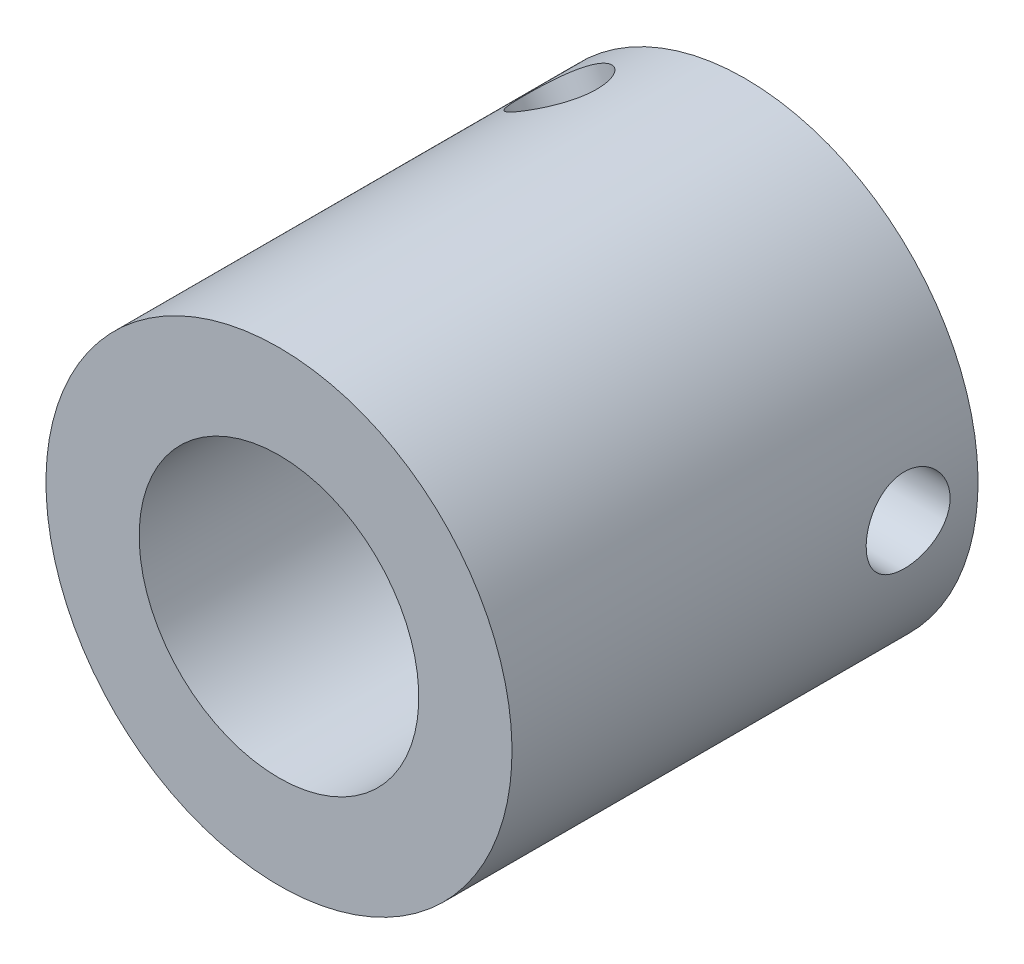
ISO-10303-21;
HEADER;
FILE_DESCRIPTION(('STEP AP214'),'2;1');
FILE_NAME('part.step','',(''),(''),'','','');
FILE_SCHEMA(('AUTOMOTIVE_DESIGN { 1 0 10303 214 1 1 1 1 }'));
ENDSEC;
DATA;
#1=APPLICATION_CONTEXT('core data for automotive mechanical design processes');
#2=APPLICATION_PROTOCOL_DEFINITION('international standard','automotive_design',2000,#1);
#3=PRODUCT_CONTEXT('',#1,'mechanical');
#4=PRODUCT('Part','Part','',(#3));
#5=PRODUCT_RELATED_PRODUCT_CATEGORY('part','',(#4));
#6=PRODUCT_DEFINITION_FORMATION('','',#4);
#7=PRODUCT_DEFINITION_CONTEXT('part definition',#1,'design');
#8=PRODUCT_DEFINITION('design','',#6,#7);
#9=PRODUCT_DEFINITION_SHAPE('','',#8);
#10=(LENGTH_UNIT() NAMED_UNIT(*) SI_UNIT(.MILLI.,.METRE.));
#11=(NAMED_UNIT(*) PLANE_ANGLE_UNIT() SI_UNIT($,.RADIAN.));
#12=(NAMED_UNIT(*) SI_UNIT($,.STERADIAN.) SOLID_ANGLE_UNIT());
#13=UNCERTAINTY_MEASURE_WITH_UNIT(LENGTH_MEASURE(1.E-05),#10,'distance_accuracy_value','');
#14=(GEOMETRIC_REPRESENTATION_CONTEXT(3) GLOBAL_UNCERTAINTY_ASSIGNED_CONTEXT((#13)) GLOBAL_UNIT_ASSIGNED_CONTEXT((#10,
#11,#12)) REPRESENTATION_CONTEXT('',''));
#15=CARTESIAN_POINT('',(0.,0.,0.));
#16=DIRECTION('',(0.,0.,1.));
#17=DIRECTION('',(1.,0.,0.));
#18=AXIS2_PLACEMENT_3D('',#15,#16,#17);
#19=CARTESIAN_POINT('',(10.,0.,3.));
#20=DIRECTION('',(1.,0.,0.));
#21=DIRECTION('',(0.,0.,1.));
#22=AXIS2_PLACEMENT_3D('',#19,#20,#21);
#23=CYLINDRICAL_SURFACE('',#22,1.8);
#24=CARTESIAN_POINT('',(6.,0.,1.2));
#25=CARTESIAN_POINT('',(5.99999644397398,-0.0986185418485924,1.20000535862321));
#26=CARTESIAN_POINT('',(5.9975419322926,-0.197344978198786,1.20814170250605));
#27=CARTESIAN_POINT('',(5.98797637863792,-0.392019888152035,1.240429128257));
#28=CARTESIAN_POINT('',(5.98085713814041,-0.487963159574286,1.26460840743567));
#29=CARTESIAN_POINT('',(5.96274502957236,-0.67408989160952,1.32810047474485));
#30=CARTESIAN_POINT('',(5.95176011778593,-0.764284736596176,1.36738219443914));
#31=CARTESIAN_POINT('',(5.92706108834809,-0.936775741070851,1.4598598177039));
#32=CARTESIAN_POINT('',(5.91334745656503,-1.01907330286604,1.51305324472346));
#33=CARTESIAN_POINT('',(5.88420923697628,-1.17584367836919,1.63346715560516));
#34=CARTESIAN_POINT('',(5.86874944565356,-1.25005754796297,1.7010162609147));
#35=CARTESIAN_POINT('',(5.83807084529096,-1.38629574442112,1.84752676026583));
#36=CARTESIAN_POINT('',(5.82285209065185,-1.44831735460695,1.92649069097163));
#37=CARTESIAN_POINT('',(5.79400932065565,-1.55976060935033,2.09576517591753));
#38=CARTESIAN_POINT('',(5.78042879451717,-1.60886801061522,2.18629072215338));
#39=CARTESIAN_POINT('',(5.75692338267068,-1.69105695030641,2.37478771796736));
#40=CARTESIAN_POINT('',(5.74699759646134,-1.72414243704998,2.47275732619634));
#41=CARTESIAN_POINT('',(5.73229045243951,-1.77241959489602,2.67046828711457));
#42=CARTESIAN_POINT('',(5.72737283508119,-1.78808634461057,2.77008322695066));
#43=CARTESIAN_POINT('',(5.72283347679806,-1.80256476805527,2.97063972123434));
#44=CARTESIAN_POINT('',(5.72321045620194,-1.80138051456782,3.071580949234));
#45=CARTESIAN_POINT('',(5.72909692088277,-1.7825637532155,3.26806042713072));
#46=CARTESIAN_POINT('',(5.734420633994,-1.76552656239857,3.36366217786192));
#47=CARTESIAN_POINT('',(5.7493002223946,-1.71644921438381,3.55058324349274));
#48=CARTESIAN_POINT('',(5.7588565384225,-1.68440749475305,3.6419021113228));
#49=CARTESIAN_POINT('',(5.78127313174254,-1.60579117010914,3.81912306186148));
#50=CARTESIAN_POINT('',(5.79417696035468,-1.55902311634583,3.90493358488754));
#51=CARTESIAN_POINT('',(5.82181271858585,-1.4524190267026,4.06768300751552));
#52=CARTESIAN_POINT('',(5.83654498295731,-1.39258059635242,4.14462027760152));
#53=CARTESIAN_POINT('',(5.86692929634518,-1.25858836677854,4.29080973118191));
#54=CARTESIAN_POINT('',(5.88259411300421,-1.18394259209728,4.35960905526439));
#55=CARTESIAN_POINT('',(5.91254166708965,-1.0239459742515,4.48384449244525));
#56=CARTESIAN_POINT('',(5.92682380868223,-0.93859055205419,4.5392748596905));
#57=CARTESIAN_POINT('',(5.95252954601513,-0.758749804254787,4.63547494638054));
#58=CARTESIAN_POINT('',(5.96393115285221,-0.664201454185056,4.67613287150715));
#59=CARTESIAN_POINT('',(5.98241497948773,-0.469295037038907,4.74076423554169));
#60=CARTESIAN_POINT('',(5.98950610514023,-0.368949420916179,4.76477208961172));
#61=CARTESIAN_POINT('',(5.99601591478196,-0.223094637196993,4.78668306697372));
#62=CARTESIAN_POINT('',(5.99750582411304,-0.178642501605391,4.79167133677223));
#63=CARTESIAN_POINT('',(5.99949867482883,-0.089467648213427,4.79833102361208));
#64=CARTESIAN_POINT('',(6.00000161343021,-0.044744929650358,4.80000243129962));
#65=CARTESIAN_POINT('',(5.99999644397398,0.0986185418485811,4.79999464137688));
#66=CARTESIAN_POINT('',(5.9975419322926,0.197344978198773,4.79185829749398));
#67=CARTESIAN_POINT('',(5.98797637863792,0.392019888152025,4.75957087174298));
#68=CARTESIAN_POINT('',(5.98085713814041,0.487963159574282,4.73539159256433));
#69=CARTESIAN_POINT('',(5.96274502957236,0.674089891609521,4.67189952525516));
#70=CARTESIAN_POINT('',(5.95176011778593,0.764284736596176,4.63261780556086));
#71=CARTESIAN_POINT('',(5.92706108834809,0.936775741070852,4.5401401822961));
#72=CARTESIAN_POINT('',(5.91334745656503,1.01907330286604,4.48694675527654));
#73=CARTESIAN_POINT('',(5.88420923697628,1.17584367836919,4.36653284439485));
#74=CARTESIAN_POINT('',(5.86874944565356,1.25005754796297,4.2989837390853));
#75=CARTESIAN_POINT('',(5.83807084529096,1.38629574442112,4.15247323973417));
#76=CARTESIAN_POINT('',(5.82285209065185,1.44831735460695,4.07350930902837));
#77=CARTESIAN_POINT('',(5.79400932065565,1.55976060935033,3.90423482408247));
#78=CARTESIAN_POINT('',(5.78042879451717,1.60886801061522,3.81370927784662));
#79=CARTESIAN_POINT('',(5.75692338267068,1.69105695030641,3.62521228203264));
#80=CARTESIAN_POINT('',(5.74699759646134,1.72414243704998,3.52724267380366));
#81=CARTESIAN_POINT('',(5.73229045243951,1.77241959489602,3.32953171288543));
#82=CARTESIAN_POINT('',(5.72737283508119,1.78808634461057,3.22991677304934));
#83=CARTESIAN_POINT('',(5.72283347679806,1.80256476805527,3.02936027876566));
#84=CARTESIAN_POINT('',(5.72321045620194,1.80138051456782,2.92841905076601));
#85=CARTESIAN_POINT('',(5.72909692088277,1.7825637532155,2.73193957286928));
#86=CARTESIAN_POINT('',(5.734420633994,1.76552656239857,2.63633782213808));
#87=CARTESIAN_POINT('',(5.7493002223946,1.71644921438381,2.44941675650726));
#88=CARTESIAN_POINT('',(5.7588565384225,1.68440749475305,2.3580978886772));
#89=CARTESIAN_POINT('',(5.78127313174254,1.60579117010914,2.18087693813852));
#90=CARTESIAN_POINT('',(5.79417696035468,1.55902311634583,2.09506641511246));
#91=CARTESIAN_POINT('',(5.82181271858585,1.4524190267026,1.93231699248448));
#92=CARTESIAN_POINT('',(5.83654498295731,1.39258059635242,1.85537972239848));
#93=CARTESIAN_POINT('',(5.86692929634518,1.25858836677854,1.70919026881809));
#94=CARTESIAN_POINT('',(5.88259411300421,1.18394259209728,1.64039094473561));
#95=CARTESIAN_POINT('',(5.91254166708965,1.0239459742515,1.51615550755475));
#96=CARTESIAN_POINT('',(5.92682380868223,0.93859055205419,1.4607251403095));
#97=CARTESIAN_POINT('',(5.95252954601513,0.758749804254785,1.36452505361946));
#98=CARTESIAN_POINT('',(5.96393115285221,0.664201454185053,1.32386712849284));
#99=CARTESIAN_POINT('',(5.98241497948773,0.469295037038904,1.25923576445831));
#100=CARTESIAN_POINT('',(5.98950610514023,0.368949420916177,1.23522791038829));
#101=CARTESIAN_POINT('',(5.99601591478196,0.223094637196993,1.21331693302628));
#102=CARTESIAN_POINT('',(5.99750582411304,0.178642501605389,1.20832866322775));
#103=CARTESIAN_POINT('',(5.99949867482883,0.0894676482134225,1.20166897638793));
#104=CARTESIAN_POINT('',(6.00000161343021,0.044744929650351,1.19999756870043));
#105=CARTESIAN_POINT('',(6.,0.,1.2));
#106=B_SPLINE_CURVE_WITH_KNOTS('',3,(#24,#25,#26,#27,#28,#29,#30,#31,#32,#33,#34,#35,#36,#37,
#38,#39,#40,#41,#42,#43,#44,#45,#46,#47,#48,#49,#50,#51,#52,#53,#54,#55,#56,#57,#58,#59,#60,#61,
#62,#63,#64,#65,#66,#67,#68,#69,#70,#71,#72,#73,#74,#75,#76,#77,#78,#79,#80,#81,#82,#83,#84,#85,
#86,#87,#88,#89,#90,#91,#92,#93,#94,#95,#96,#97,#98,#99,#100,#101,#102,#103,#104,#105),
.UNSPECIFIED.,.T.,.F.,(4,2,2,2,2,2,2,2,2,2,2,2,2,2,2,2,2,2,2,2,2,2,2,2,2,2,2,2,2,2,2,2,2,2,2,2,
2,2,2,2,4),(0.,0.295683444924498,0.591887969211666,0.887486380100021,1.18303220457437,
1.48625898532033,1.78955325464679,2.09965874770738,2.40968778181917,2.71103618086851,
3.01231174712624,3.30271141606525,3.59314133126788,3.88755783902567,4.18202832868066,
4.48874910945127,4.79560148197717,5.1047299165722,5.41321747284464,5.54737376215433,
5.6815304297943,5.9772138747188,6.27341839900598,6.56901680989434,6.86456263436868,
7.16778941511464,7.47108368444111,7.78118917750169,8.09121821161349,8.39256661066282,
8.69384217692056,8.98424184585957,9.27467176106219,9.56908826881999,9.86355875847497,
10.1702795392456,10.4771319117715,10.7862603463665,11.094747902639,11.2289041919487,
11.3630608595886),.UNSPECIFIED.);
#107=CARTESIAN_POINT('',(6.,0.,1.2));
#108=VERTEX_POINT('',#107);
#109=EDGE_CURVE('E16',#108,#108,#106,.T.);
#110=ORIENTED_EDGE('',*,*,#109,.T.);
#111=EDGE_LOOP('',(#110));
#112=FACE_BOUND('',#111,.T.);
#113=CARTESIAN_POINT('',(10.,0.,1.2));
#114=CARTESIAN_POINT('',(9.99999792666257,-0.100138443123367,1.20000468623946));
#115=CARTESIAN_POINT('',(9.99847890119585,-0.200403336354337,1.20839204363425));
#116=CARTESIAN_POINT('',(9.99256124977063,-0.398189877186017,1.2417225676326));
#117=CARTESIAN_POINT('',(9.98815683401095,-0.495705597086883,1.26669902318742));
#118=CARTESIAN_POINT('',(9.97696172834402,-0.684989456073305,1.33242473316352));
#119=CARTESIAN_POINT('',(9.9701741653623,-0.776764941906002,1.37315332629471));
#120=CARTESIAN_POINT('',(9.95495763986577,-0.952142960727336,1.46917704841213));
#121=CARTESIAN_POINT('',(9.9465292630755,-1.03574839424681,1.52446698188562));
#122=CARTESIAN_POINT('',(9.92885621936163,-1.19338882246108,1.64870648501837));
#123=CARTESIAN_POINT('',(9.91960421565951,-1.26731946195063,1.7177874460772));
#124=CARTESIAN_POINT('',(9.90138142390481,-1.40261092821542,1.86736851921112));
#125=CARTESIAN_POINT('',(9.89241066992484,-1.46397023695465,1.94787000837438));
#126=CARTESIAN_POINT('',(9.87569637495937,-1.57279517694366,2.11872462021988));
#127=CARTESIAN_POINT('',(9.86796217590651,-1.6201571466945,2.20914476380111));
#128=CARTESIAN_POINT('',(9.85469826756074,-1.69897904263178,2.39681974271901));
#129=CARTESIAN_POINT('',(9.84916836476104,-1.73044036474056,2.49407397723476));
#130=CARTESIAN_POINT('',(9.84101185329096,-1.77623939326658,2.6915561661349));
#131=CARTESIAN_POINT('',(9.8383548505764,-1.79075649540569,2.79174123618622));
#132=CARTESIAN_POINT('',(9.83615323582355,-1.80281159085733,2.99315783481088));
#133=CARTESIAN_POINT('',(9.83660837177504,-1.80035095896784,3.09438927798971));
#134=CARTESIAN_POINT('',(9.84055190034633,-1.77866619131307,3.29373143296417));
#135=CARTESIAN_POINT('',(9.84400352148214,-1.75964526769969,3.39186508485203));
#136=CARTESIAN_POINT('',(9.85349347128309,-1.70569919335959,3.5835259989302));
#137=CARTESIAN_POINT('',(9.85953192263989,-1.67077328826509,3.67705304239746));
#138=CARTESIAN_POINT('',(9.87355429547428,-1.58580593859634,3.85744754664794));
#139=CARTESIAN_POINT('',(9.88154890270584,-1.53568109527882,3.94427486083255));
#140=CARTESIAN_POINT('',(9.89857482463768,-1.42180184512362,4.10835629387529));
#141=CARTESIAN_POINT('',(9.90760615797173,-1.35804719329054,4.18561024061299));
#142=CARTESIAN_POINT('',(9.92584751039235,-1.21763063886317,4.32952111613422));
#143=CARTESIAN_POINT('',(9.93505823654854,-1.14079701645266,4.39601049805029));
#144=CARTESIAN_POINT('',(9.95250580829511,-0.976936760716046,4.51520980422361));
#145=CARTESIAN_POINT('',(9.96074222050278,-0.889905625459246,4.56791360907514));
#146=CARTESIAN_POINT('',(9.97532870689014,-0.707929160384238,4.65806284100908));
#147=CARTESIAN_POINT('',(9.98167520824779,-0.612969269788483,4.69547941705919));
#148=CARTESIAN_POINT('',(9.99172969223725,-0.418096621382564,4.75370936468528));
#149=CARTESIAN_POINT('',(9.99544322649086,-0.318194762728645,4.77455768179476));
#150=CARTESIAN_POINT('',(9.99842222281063,-0.181296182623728,4.79121663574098));
#151=CARTESIAN_POINT('',(9.99901260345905,-0.145122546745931,4.79450767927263));
#152=CARTESIAN_POINT('',(9.99980186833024,-0.0726381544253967,4.7989002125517));
#153=CARTESIAN_POINT('',(10.0000007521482,-0.0363273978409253,4.80000170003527));
#154=CARTESIAN_POINT('',(9.99999792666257,0.100138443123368,4.79999531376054));
#155=CARTESIAN_POINT('',(9.99847890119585,0.200403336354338,4.79160795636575));
#156=CARTESIAN_POINT('',(9.99256124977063,0.398189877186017,4.7582774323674));
#157=CARTESIAN_POINT('',(9.98815683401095,0.495705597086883,4.73330097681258));
#158=CARTESIAN_POINT('',(9.97696172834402,0.684989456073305,4.66757526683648));
#159=CARTESIAN_POINT('',(9.9701741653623,0.776764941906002,4.62684667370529));
#160=CARTESIAN_POINT('',(9.95495763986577,0.952142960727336,4.53082295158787));
#161=CARTESIAN_POINT('',(9.9465292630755,1.03574839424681,4.47553301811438));
#162=CARTESIAN_POINT('',(9.92885621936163,1.19338882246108,4.35129351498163));
#163=CARTESIAN_POINT('',(9.91960421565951,1.26731946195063,4.2822125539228));
#164=CARTESIAN_POINT('',(9.90138142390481,1.40261092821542,4.13263148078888));
#165=CARTESIAN_POINT('',(9.89241066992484,1.46397023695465,4.05212999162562));
#166=CARTESIAN_POINT('',(9.87569637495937,1.57279517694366,3.88127537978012));
#167=CARTESIAN_POINT('',(9.86796217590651,1.6201571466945,3.79085523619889));
#168=CARTESIAN_POINT('',(9.85469826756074,1.69897904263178,3.60318025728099));
#169=CARTESIAN_POINT('',(9.84916836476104,1.73044036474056,3.50592602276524));
#170=CARTESIAN_POINT('',(9.84101185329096,1.77623939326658,3.3084438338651));
#171=CARTESIAN_POINT('',(9.8383548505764,1.79075649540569,3.20825876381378));
#172=CARTESIAN_POINT('',(9.83615323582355,1.80281159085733,3.00684216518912));
#173=CARTESIAN_POINT('',(9.83660837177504,1.80035095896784,2.90561072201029));
#174=CARTESIAN_POINT('',(9.84055190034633,1.77866619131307,2.70626856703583));
#175=CARTESIAN_POINT('',(9.84400352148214,1.75964526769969,2.60813491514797));
#176=CARTESIAN_POINT('',(9.85349347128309,1.70569919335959,2.4164740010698));
#177=CARTESIAN_POINT('',(9.85953192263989,1.67077328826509,2.32294695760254));
#178=CARTESIAN_POINT('',(9.87355429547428,1.58580593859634,2.14255245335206));
#179=CARTESIAN_POINT('',(9.88154890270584,1.53568109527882,2.05572513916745));
#180=CARTESIAN_POINT('',(9.89857482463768,1.42180184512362,1.89164370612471));
#181=CARTESIAN_POINT('',(9.90760615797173,1.35804719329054,1.81438975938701));
#182=CARTESIAN_POINT('',(9.92584751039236,1.21763063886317,1.67047888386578));
#183=CARTESIAN_POINT('',(9.93505823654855,1.14079701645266,1.60398950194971));
#184=CARTESIAN_POINT('',(9.95250580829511,0.976936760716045,1.48479019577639));
#185=CARTESIAN_POINT('',(9.96074222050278,0.889905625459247,1.43208639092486));
#186=CARTESIAN_POINT('',(9.97532870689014,0.707929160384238,1.34193715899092));
#187=CARTESIAN_POINT('',(9.98167520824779,0.612969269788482,1.30452058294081));
#188=CARTESIAN_POINT('',(9.99172969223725,0.418096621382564,1.24629063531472));
#189=CARTESIAN_POINT('',(9.99544322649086,0.318194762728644,1.22544231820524));
#190=CARTESIAN_POINT('',(9.99842222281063,0.181296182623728,1.20878336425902));
#191=CARTESIAN_POINT('',(9.99901260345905,0.145122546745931,1.20549232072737));
#192=CARTESIAN_POINT('',(9.99980186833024,0.0726381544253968,1.2010997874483));
#193=CARTESIAN_POINT('',(10.0000007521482,0.0363273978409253,1.19999829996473));
#194=CARTESIAN_POINT('',(10.,0.,1.2));
#195=B_SPLINE_CURVE_WITH_KNOTS('',3,(#113,#114,#115,#116,#117,#118,#119,#120,#121,#122,#123,
#124,#125,#126,#127,#128,#129,#130,#131,#132,#133,#134,#135,#136,#137,#138,#139,#140,#141,#142,
#143,#144,#145,#146,#147,#148,#149,#150,#151,#152,#153,#154,#155,#156,#157,#158,#159,#160,#161,
#162,#163,#164,#165,#166,#167,#168,#169,#170,#171,#172,#173,#174,#175,#176,#177,#178,#179,#180,
#181,#182,#183,#184,#185,#186,#187,#188,#189,#190,#191,#192,#193,#194),.UNSPECIFIED.,.T.,.F.,(4,
2,2,2,2,2,2,2,2,2,2,2,2,2,2,2,2,2,2,2,2,2,2,2,2,2,2,2,2,2,2,2,2,2,2,2,2,2,2,2,4),(0.,
0.300276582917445,0.601157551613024,0.901645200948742,1.20202578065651,1.50541792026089,
1.808846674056,2.11446927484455,2.42006504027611,2.72239510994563,3.02470069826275,
3.3233481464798,3.62200976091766,3.92234077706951,4.22267719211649,4.52731338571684,
4.83208457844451,5.13742832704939,5.44212632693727,5.55105807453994,5.65998993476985,
5.9602665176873,6.26114748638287,6.56163513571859,6.86201571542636,7.16540785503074,
7.46883660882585,7.7744592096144,8.08005497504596,8.38238504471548,8.6846906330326,
8.98333808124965,9.28199969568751,9.58233071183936,9.88266712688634,10.1873033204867,
10.4920745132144,10.7974182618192,11.1021162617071,11.2110480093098,11.3199798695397),.UNSPECIFIED.);
#196=CARTESIAN_POINT('',(10.,0.,1.2));
#197=VERTEX_POINT('',#196);
#198=EDGE_CURVE('E45',#197,#197,#195,.T.);
#199=ORIENTED_EDGE('',*,*,#198,.F.);
#200=EDGE_LOOP('',(#199));
#201=FACE_BOUND('',#200,.T.);
#202=ADVANCED_FACE('F12',(#112,#201),#23,.F.);
#203=CARTESIAN_POINT('',(0.,0.,45.4558441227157));
#204=DIRECTION('',(0.,0.,-1.));
#205=DIRECTION('',(0.,1.,0.));
#206=AXIS2_PLACEMENT_3D('',#203,#204,#205);
#207=CYLINDRICAL_SURFACE('',#206,6.);
#208=CARTESIAN_POINT('',(0.,0.,0.));
#209=DIRECTION('',(0.,0.,-1.));
#210=DIRECTION('',(0.,1.,0.));
#211=AXIS2_PLACEMENT_3D('',#208,#209,#210);
#212=CIRCLE('',#211,6.);
#213=CARTESIAN_POINT('',(0.,6.,0.));
#214=VERTEX_POINT('',#213);
#215=EDGE_CURVE('E51',#214,#214,#212,.T.);
#216=ORIENTED_EDGE('',*,*,#215,.T.);
#217=EDGE_LOOP('',(#216));
#218=FACE_BOUND('',#217,.T.);
#219=CARTESIAN_POINT('',(0.,0.,20.));
#220=DIRECTION('',(0.,0.,-1.));
#221=DIRECTION('',(0.,1.,0.));
#222=AXIS2_PLACEMENT_3D('',#219,#220,#221);
#223=CIRCLE('',#222,6.);
#224=CARTESIAN_POINT('',(0.,6.,20.));
#225=VERTEX_POINT('',#224);
#226=EDGE_CURVE('E52',#225,#225,#223,.T.);
#227=ORIENTED_EDGE('',*,*,#226,.F.);
#228=EDGE_LOOP('',(#227));
#229=FACE_BOUND('',#228,.T.);
#230=CARTESIAN_POINT('',(-4.42066333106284,4.05681349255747,3.));
#231=CARTESIAN_POINT('',(-4.42066070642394,4.05681984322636,3.09850594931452));
#232=CARTESIAN_POINT('',(-4.4149150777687,4.06310502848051,3.19712044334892));
#233=CARTESIAN_POINT('',(-4.39200938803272,4.08785082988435,3.39156178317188));
#234=CARTESIAN_POINT('',(-4.37482894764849,4.10633318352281,3.48738333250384));
#235=CARTESIAN_POINT('',(-4.32936924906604,4.15423179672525,3.67325209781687));
#236=CARTESIAN_POINT('',(-4.30111481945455,4.18362358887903,3.76331171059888));
#237=CARTESIAN_POINT('',(-4.23390831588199,4.25162270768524,3.93557271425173));
#238=CARTESIAN_POINT('',(-4.1949579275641,4.29022858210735,4.01777534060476));
#239=CARTESIAN_POINT('',(-4.10555885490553,4.37587917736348,4.17463721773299));
#240=CARTESIAN_POINT('',(-4.05481129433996,4.42313493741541,4.2490109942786));
#241=CARTESIAN_POINT('',(-3.94313452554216,4.52297386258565,4.38556228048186));
#242=CARTESIAN_POINT('',(-3.88220346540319,4.57555799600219,4.44773756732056));
#243=CARTESIAN_POINT('',(-3.74969467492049,4.68479477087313,4.55935539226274));
#244=CARTESIAN_POINT('',(-3.6779230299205,4.74150901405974,4.60850840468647));
#245=CARTESIAN_POINT('',(-3.52609435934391,4.85547663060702,4.6907849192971));
#246=CARTESIAN_POINT('',(-3.44603917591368,4.91272988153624,4.72391197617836));
#247=CARTESIAN_POINT('',(-3.28197084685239,5.02376293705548,4.7722559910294));
#248=CARTESIAN_POINT('',(-3.19813641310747,5.07759525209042,4.78795814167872));
#249=CARTESIAN_POINT('',(-3.0267984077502,5.18155610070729,4.80254079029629));
#250=CARTESIAN_POINT('',(-2.93929560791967,5.23168540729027,4.80142480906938));
#251=CARTESIAN_POINT('',(-2.76611510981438,5.32522219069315,4.78272858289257));
#252=CARTESIAN_POINT('',(-2.68046804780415,5.36879290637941,4.76567386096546));
#253=CARTESIAN_POINT('',(-2.51081790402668,5.4501973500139,4.71644255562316));
#254=CARTESIAN_POINT('',(-2.42681493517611,5.48803068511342,4.68426493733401));
#255=CARTESIAN_POINT('',(-2.26203353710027,5.55799580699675,4.60534443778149));
#256=CARTESIAN_POINT('',(-2.18130419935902,5.59005587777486,4.55843590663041));
#257=CARTESIAN_POINT('',(-2.02658370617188,5.64799018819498,4.45151897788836));
#258=CARTESIAN_POINT('',(-1.95259376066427,5.67386331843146,4.39150823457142));
#259=CARTESIAN_POINT('',(-1.81098406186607,5.72067442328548,4.25737548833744));
#260=CARTESIAN_POINT('',(-1.74371790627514,5.74138480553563,4.18280019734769));
#261=CARTESIAN_POINT('',(-1.62131631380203,5.77714568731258,4.02301776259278));
#262=CARTESIAN_POINT('',(-1.56618650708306,5.79219356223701,3.93780571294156));
#263=CARTESIAN_POINT('',(-1.4698075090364,5.81740336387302,3.75803627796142));
#264=CARTESIAN_POINT('',(-1.42870733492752,5.82751330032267,3.66339157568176));
#265=CARTESIAN_POINT('',(-1.36318253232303,5.84319151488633,3.46827122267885));
#266=CARTESIAN_POINT('',(-1.33872269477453,5.84876938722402,3.3678083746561));
#267=CARTESIAN_POINT('',(-1.31646278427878,5.85379886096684,3.22203878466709));
#268=CARTESIAN_POINT('',(-1.31141094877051,5.85493069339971,3.17779682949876));
#269=CARTESIAN_POINT('',(-1.30466394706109,5.85643780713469,3.08904397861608));
#270=CARTESIAN_POINT('',(-1.30296879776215,5.85681308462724,3.04453308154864));
#271=CARTESIAN_POINT('',(-1.30297868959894,5.85681439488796,2.90149405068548));
#272=CARTESIAN_POINT('',(-1.31129463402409,5.8549811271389,2.80287955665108));
#273=CARTESIAN_POINT('',(-1.3441779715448,5.84751711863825,2.60843821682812));
#274=CARTESIAN_POINT('',(-1.36877437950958,5.84187959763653,2.51261666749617));
#275=CARTESIAN_POINT('',(-1.43298564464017,5.82645965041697,2.32674790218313));
#276=CARTESIAN_POINT('',(-1.47256689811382,5.81668649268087,2.23668828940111));
#277=CARTESIAN_POINT('',(-1.56505911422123,5.79248351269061,2.06442728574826));
#278=CARTESIAN_POINT('',(-1.61796797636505,5.7780544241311,1.98222465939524));
#279=CARTESIAN_POINT('',(-1.73684310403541,5.74345785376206,1.825362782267));
#280=CARTESIAN_POINT('',(-1.80314157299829,5.72313705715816,1.75098900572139));
#281=CARTESIAN_POINT('',(-1.94544300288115,5.67634160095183,1.61443771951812));
#282=CARTESIAN_POINT('',(-2.02144772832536,5.64986582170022,1.55226243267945));
#283=CARTESIAN_POINT('',(-2.18230394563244,5.58972823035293,1.44064460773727));
#284=CARTESIAN_POINT('',(-2.26730574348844,5.55592928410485,1.39149159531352));
#285=CARTESIAN_POINT('',(-2.44191892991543,5.48142560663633,1.30921508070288));
#286=CARTESIAN_POINT('',(-2.53152929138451,5.44072240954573,1.27608802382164));
#287=CARTESIAN_POINT('',(-2.70972090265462,5.35415159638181,1.22774400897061));
#288=CARTESIAN_POINT('',(-2.79825827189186,5.3084650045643,1.21204185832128));
#289=CARTESIAN_POINT('',(-2.9739600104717,5.21206236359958,1.19745920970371));
#290=CARTESIAN_POINT('',(-3.06112466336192,5.16134736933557,1.19857519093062));
#291=CARTESIAN_POINT('',(-3.22872014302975,5.05813705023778,1.21727141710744));
#292=CARTESIAN_POINT('',(-3.30927702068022,5.00574987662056,1.23432613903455));
#293=CARTESIAN_POINT('',(-3.46460040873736,4.89953076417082,1.28355744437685));
#294=CARTESIAN_POINT('',(-3.53936652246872,4.84569872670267,1.31573506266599));
#295=CARTESIAN_POINT('',(-3.68234879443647,4.73797641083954,1.39465556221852));
#296=CARTESIAN_POINT('',(-3.75047829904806,4.68409278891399,1.44156409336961));
#297=CARTESIAN_POINT('',(-3.8780111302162,4.57906806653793,1.54848102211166));
#298=CARTESIAN_POINT('',(-3.93741289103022,4.52792745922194,1.60849176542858));
#299=CARTESIAN_POINT('',(-4.04875734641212,4.42869541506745,1.74262451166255));
#300=CARTESIAN_POINT('',(-4.10032614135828,4.38079640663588,1.81719980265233));
#301=CARTESIAN_POINT('',(-4.19249676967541,4.29267395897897,1.97698223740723));
#302=CARTESIAN_POINT('',(-4.23309351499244,4.25245408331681,2.06219428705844));
#303=CARTESIAN_POINT('',(-4.30311534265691,4.18159232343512,2.24196372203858));
#304=CARTESIAN_POINT('',(-4.33242089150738,4.15105349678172,2.33660842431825));
#305=CARTESIAN_POINT('',(-4.37876102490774,4.10214646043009,2.53172877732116));
#306=CARTESIAN_POINT('',(-4.39582152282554,4.08375255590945,2.6321916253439));
#307=CARTESIAN_POINT('',(-4.41130713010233,4.0669896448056,2.77796121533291));
#308=CARTESIAN_POINT('',(-4.41481324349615,4.06318054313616,2.82220317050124));
#309=CARTESIAN_POINT('',(-4.41949194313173,4.05809102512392,2.91095602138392));
#310=CARTESIAN_POINT('',(-4.42066451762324,4.05681062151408,2.95546691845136));
#311=CARTESIAN_POINT('',(-4.42066333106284,4.05681349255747,3.));
#312=B_SPLINE_CURVE_WITH_KNOTS('',3,(#230,#231,#232,#233,#234,#235,#236,#237,#238,#239,#240,
#241,#242,#243,#244,#245,#246,#247,#248,#249,#250,#251,#252,#253,#254,#255,#256,#257,#258,#259,
#260,#261,#262,#263,#264,#265,#266,#267,#268,#269,#270,#271,#272,#273,#274,#275,#276,#277,#278,
#279,#280,#281,#282,#283,#284,#285,#286,#287,#288,#289,#290,#291,#292,#293,#294,#295,#296,#297,
#298,#299,#300,#301,#302,#303,#304,#305,#306,#307,#308,#309,#310,#311),.UNSPECIFIED.,.T.,.F.,(4,
2,2,2,2,2,2,2,2,2,2,2,2,2,2,2,2,2,2,2,2,2,2,2,2,2,2,2,2,2,2,2,2,2,2,2,2,2,2,2,4),(0.,
0.295345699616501,0.591219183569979,0.886433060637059,1.18160043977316,1.48526966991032,
1.78899418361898,2.0989922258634,2.4089214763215,2.70998558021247,3.01098665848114,
3.3024007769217,3.59383484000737,3.88867110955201,4.18356020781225,4.48977010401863,
4.7961217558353,5.10563287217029,5.41448704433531,5.54800779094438,5.68152920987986,
5.97687490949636,6.27274839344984,6.56796227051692,6.86312964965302,7.16679887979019,
7.47052339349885,7.78052143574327,8.09045068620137,8.39151479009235,8.69251586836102,
8.98392998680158,9.27536404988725,9.57020031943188,9.86508941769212,10.1712993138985,
10.4776509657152,10.7871620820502,11.0960162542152,11.2295370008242,11.3630584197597),.UNSPECIFIED.);
#313=CARTESIAN_POINT('',(-4.42066333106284,4.05681349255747,3.));
#314=VERTEX_POINT('',#313);
#315=EDGE_CURVE('E77',#314,#314,#312,.T.);
#316=ORIENTED_EDGE('',*,*,#315,.T.);
#317=EDGE_LOOP('',(#316));
#318=FACE_BOUND('',#317,.T.);
#319=ORIENTED_EDGE('',*,*,#109,.F.);
#320=EDGE_LOOP('',(#319));
#321=FACE_BOUND('',#320,.T.);
#322=ADVANCED_FACE('F62',(#218,#229,#318,#321),#207,.F.);
#323=CARTESIAN_POINT('',(0.,0.,20.));
#324=DIRECTION('',(0.,0.,1.));
#325=DIRECTION('',(0.,-1.,0.));
#326=AXIS2_PLACEMENT_3D('',#323,#324,#325);
#327=PLANE('',#326);
#328=ORIENTED_EDGE('',*,*,#226,.T.);
#329=EDGE_LOOP('',(#328));
#330=FACE_BOUND('',#329,.T.);
#331=CARTESIAN_POINT('',(0.,0.,20.));
#332=DIRECTION('',(0.,0.,-1.));
#333=DIRECTION('',(0.,1.,0.));
#334=AXIS2_PLACEMENT_3D('',#331,#332,#333);
#335=CIRCLE('',#334,10.);
#336=CARTESIAN_POINT('',(0.,10.,20.));
#337=VERTEX_POINT('',#336);
#338=EDGE_CURVE('E28',#337,#337,#335,.T.);
#339=ORIENTED_EDGE('',*,*,#338,.F.);
#340=EDGE_LOOP('',(#339));
#341=FACE_BOUND('',#340,.T.);
#342=ADVANCED_FACE('F64',(#330,#341),#327,.T.);
#343=CARTESIAN_POINT('',(0.,0.,0.));
#344=DIRECTION('',(0.,0.,1.));
#345=DIRECTION('',(0.,-1.,0.));
#346=AXIS2_PLACEMENT_3D('',#343,#344,#345);
#347=PLANE('',#346);
#348=ORIENTED_EDGE('',*,*,#215,.F.);
#349=EDGE_LOOP('',(#348));
#350=FACE_BOUND('',#349,.T.);
#351=CARTESIAN_POINT('',(0.,0.,0.));
#352=DIRECTION('',(0.,0.,-1.));
#353=DIRECTION('',(0.,1.,0.));
#354=AXIS2_PLACEMENT_3D('',#351,#352,#353);
#355=CIRCLE('',#354,10.);
#356=CARTESIAN_POINT('',(0.,10.,0.));
#357=VERTEX_POINT('',#356);
#358=EDGE_CURVE('E23',#357,#357,#355,.F.);
#359=ORIENTED_EDGE('',*,*,#358,.F.);
#360=EDGE_LOOP('',(#359));
#361=FACE_BOUND('',#360,.T.);
#362=ADVANCED_FACE('F71',(#350,#361),#347,.F.);
#363=CARTESIAN_POINT('',(-5.,8.66025403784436,3.));
#364=DIRECTION('',(-0.5,0.866025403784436,0.));
#365=DIRECTION('',(-0.866025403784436,-0.5,0.));
#366=AXIS2_PLACEMENT_3D('',#363,#364,#365);
#367=CYLINDRICAL_SURFACE('',#366,1.8);
#368=ORIENTED_EDGE('',*,*,#315,.F.);
#369=EDGE_LOOP('',(#368));
#370=FACE_BOUND('',#369,.T.);
#371=CARTESIAN_POINT('',(-6.4771787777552,7.6188027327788,3.));
#372=CARTESIAN_POINT('',(-6.47717580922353,7.61880698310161,2.89987639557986));
#373=CARTESIAN_POINT('',(-6.47068644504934,7.62433700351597,2.79962624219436));
#374=CARTESIAN_POINT('',(-6.44483457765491,7.64620053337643,2.60187040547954));
#375=CARTESIAN_POINT('',(-6.42544614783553,7.66255580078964,2.50437066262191));
#376=CARTESIAN_POINT('',(-6.37421453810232,7.70522498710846,2.31512059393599));
#377=CARTESIAN_POINT('',(-6.34238797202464,7.7315256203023,2.22336278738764));
#378=CARTESIAN_POINT('',(-6.26693437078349,7.79280979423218,2.04801451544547));
#379=CARTESIAN_POINT('',(-6.22331151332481,7.82779026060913,1.96442117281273));
#380=CARTESIAN_POINT('',(-6.1246056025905,7.90526230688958,1.8067676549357));
#381=CARTESIAN_POINT('',(-6.06940820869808,7.94782813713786,1.73281553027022));
#382=CARTESIAN_POINT('',(-5.94895032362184,8.03838649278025,1.5974824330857));
#383=CARTESIAN_POINT('',(-5.8836886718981,8.08637964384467,1.5361029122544));
#384=CARTESIAN_POINT('',(-5.74401420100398,8.18619010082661,1.42725636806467));
#385=CARTESIAN_POINT('',(-5.66954069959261,8.2380317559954,1.37988942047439));
#386=CARTESIAN_POINT('',(-5.5135724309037,8.34322213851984,1.30105739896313));
#387=CARTESIAN_POINT('',(-5.43207825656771,8.39657073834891,1.26959098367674));
#388=CARTESIAN_POINT('',(-5.26508535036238,8.50226626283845,1.22378199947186));
#389=CARTESIAN_POINT('',(-5.17963895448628,8.55461779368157,1.20925935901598));
#390=CARTESIAN_POINT('',(-5.00630940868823,8.6571937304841,1.19718952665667));
#391=CARTESIAN_POINT('',(-4.91842644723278,8.70741830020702,1.19964102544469));
#392=CARTESIAN_POINT('',(-4.74381824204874,8.80375038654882,1.22131086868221));
#393=CARTESIAN_POINT('',(-4.65709135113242,8.84989875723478,1.24033521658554));
#394=CARTESIAN_POINT('',(-4.48634526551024,8.93766900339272,1.29430467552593));
#395=CARTESIAN_POINT('',(-4.40232618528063,8.97929068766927,1.3292504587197));
#396=CARTESIAN_POINT('',(-4.23910830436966,9.05749423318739,1.41425989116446));
#397=CARTESIAN_POINT('',(-4.15993732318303,9.09404829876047,1.46440245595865));
#398=CARTESIAN_POINT('',(-4.00935476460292,9.16143489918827,1.57832003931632));
#399=CARTESIAN_POINT('',(-3.93794332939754,9.19226732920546,1.64209530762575));
#400=CARTESIAN_POINT('',(-3.80421461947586,9.24842115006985,1.78252710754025));
#401=CARTESIAN_POINT('',(-3.74203819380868,9.27365961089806,1.85935101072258));
#402=CARTESIAN_POINT('',(-3.63008074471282,9.31805527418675,2.02318310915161));
#403=CARTESIAN_POINT('',(-3.58030527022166,9.33720975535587,2.11019583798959));
#404=CARTESIAN_POINT('',(-3.49488097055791,9.36952004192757,2.29216608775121));
#405=CARTESIAN_POINT('',(-3.45926435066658,9.38266218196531,2.38714113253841));
#406=CARTESIAN_POINT('',(-3.40374434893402,9.40294697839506,2.58204697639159));
#407=CARTESIAN_POINT('',(-3.3838078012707,9.4101022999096,2.68196683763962));
#408=CARTESIAN_POINT('',(-3.36788185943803,9.41580493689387,2.81885406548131));
#409=CARTESIAN_POINT('',(-3.36473694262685,9.41692892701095,2.85499777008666));
#410=CARTESIAN_POINT('',(-3.36053873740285,9.41842790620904,2.9274221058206));
#411=CARTESIAN_POINT('',(-3.3594854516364,9.41880289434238,2.96370273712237));
#412=CARTESIAN_POINT('',(-3.35949248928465,9.41880228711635,3.10012360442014));
#413=CARTESIAN_POINT('',(-3.36752630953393,9.41594734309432,3.20037375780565));
#414=CARTESIAN_POINT('',(-3.39938661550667,9.40449073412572,3.39812959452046));
#415=CARTESIAN_POINT('',(-3.42324490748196,9.39587749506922,3.49562933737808));
#416=CARTESIAN_POINT('',(-3.48581331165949,9.37284421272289,3.68487940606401));
#417=CARTESIAN_POINT('',(-3.52450361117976,9.35843191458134,3.77663721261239));
#418=CARTESIAN_POINT('',(-3.61530406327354,9.32372926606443,3.95198548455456));
#419=CARTESIAN_POINT('',(-3.66740946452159,9.303440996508,4.03557882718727));
#420=CARTESIAN_POINT('',(-3.7838551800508,9.25669519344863,4.1932323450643));
#421=CARTESIAN_POINT('',(-3.84831696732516,9.23017576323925,4.26718446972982));
#422=CARTESIAN_POINT('',(-3.98697174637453,9.17113535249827,4.40251756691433));
#423=CARTESIAN_POINT('',(-4.06116586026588,9.13861367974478,4.4638970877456));
#424=CARTESIAN_POINT('',(-4.21744148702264,9.06755726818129,4.57274363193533));
#425=CARTESIAN_POINT('',(-4.29957442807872,9.02898215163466,4.62011057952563));
#426=CARTESIAN_POINT('',(-4.46865610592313,8.94650486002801,4.6989426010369));
#427=CARTESIAN_POINT('',(-4.55560443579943,8.90260313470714,4.73040901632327));
#428=CARTESIAN_POINT('',(-4.73063589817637,8.81083079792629,4.77621800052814));
#429=CARTESIAN_POINT('',(-4.81869685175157,8.76300781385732,4.79074064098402));
#430=CARTESIAN_POINT('',(-4.99419499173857,8.66418799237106,4.80281047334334));
#431=CARTESIAN_POINT('',(-5.08163222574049,8.6131914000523,4.80035897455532));
#432=CARTESIAN_POINT('',(-5.25236236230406,8.51014230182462,4.77868913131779));
#433=CARTESIAN_POINT('',(-5.33569146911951,8.45810879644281,4.75966478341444));
#434=CARTESIAN_POINT('',(-5.4970757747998,8.35412347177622,4.70569532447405));
#435=CARTESIAN_POINT('',(-5.57513075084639,8.30217165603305,4.6707495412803));
#436=CARTESIAN_POINT('',(-5.72446594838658,8.19992259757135,4.58574010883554));
#437=CARTESIAN_POINT('',(-5.79570818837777,8.14963554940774,4.53559754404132));
#438=CARTESIAN_POINT('',(-5.92935797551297,8.0529205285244,4.42167996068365));
#439=CARTESIAN_POINT('',(-5.99176536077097,8.0064926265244,4.35790469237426));
#440=CARTESIAN_POINT('',(-6.10726035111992,7.91875707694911,4.21747289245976));
#441=CARTESIAN_POINT('',(-6.16020571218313,7.87752994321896,4.14064898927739));
#442=CARTESIAN_POINT('',(-6.25463220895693,7.80276977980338,3.97681689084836));
#443=CARTESIAN_POINT('',(-6.29610821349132,7.76924019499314,3.88980416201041));
#444=CARTESIAN_POINT('',(-6.36680189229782,7.71141572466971,3.7078339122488));
#445=CARTESIAN_POINT('',(-6.39599162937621,7.68714189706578,3.61285886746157));
#446=CARTESIAN_POINT('',(-6.44131877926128,7.64920256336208,3.41795302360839));
#447=CARTESIAN_POINT('',(-6.45748374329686,7.6355146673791,3.31803316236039));
#448=CARTESIAN_POINT('',(-6.47038534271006,7.624573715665,3.18114593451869));
#449=CARTESIAN_POINT('',(-6.47293120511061,7.6224121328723,3.14500222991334));
#450=CARTESIAN_POINT('',(-6.4763284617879,7.61952587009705,3.0725778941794));
#451=CARTESIAN_POINT('',(-6.47717985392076,7.61880119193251,3.03629726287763));
#452=CARTESIAN_POINT('',(-6.4771787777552,7.6188027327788,3.));
#453=B_SPLINE_CURVE_WITH_KNOTS('',3,(#371,#372,#373,#374,#375,#376,#377,#378,#379,#380,#381,
#382,#383,#384,#385,#386,#387,#388,#389,#390,#391,#392,#393,#394,#395,#396,#397,#398,#399,#400,
#401,#402,#403,#404,#405,#406,#407,#408,#409,#410,#411,#412,#413,#414,#415,#416,#417,#418,#419,
#420,#421,#422,#423,#424,#425,#426,#427,#428,#429,#430,#431,#432,#433,#434,#435,#436,#437,#438,
#439,#440,#441,#442,#443,#444,#445,#446,#447,#448,#449,#450,#451,#452),.UNSPECIFIED.,.T.,.F.,(4,
2,2,2,2,2,2,2,2,2,2,2,2,2,2,2,2,2,2,2,2,2,2,2,2,2,2,2,2,2,2,2,2,2,2,2,2,2,2,2,4),(0.,
0.300232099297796,0.601069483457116,0.901506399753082,1.2018370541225,1.50528752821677,
1.8087730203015,2.11437635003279,2.41995389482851,2.72225341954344,3.02452962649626,
3.32331431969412,3.62211162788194,3.92248795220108,4.22286977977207,4.52744433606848,
4.83215493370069,5.13755470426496,5.44230675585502,5.55114811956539,5.65998962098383,
5.96022172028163,6.26105910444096,6.56149602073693,6.86182667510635,7.16527714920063,
7.46876264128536,7.77436597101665,8.07994351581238,8.3822430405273,8.68451924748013,
8.98330394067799,9.28210124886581,9.58247757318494,9.88285940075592,10.1874339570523,
10.4921445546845,10.7975443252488,11.1022963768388,11.2111377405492,11.3199792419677),.UNSPECIFIED.);
#454=CARTESIAN_POINT('',(-6.4771787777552,7.6188027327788,3.));
#455=VERTEX_POINT('',#454);
#456=EDGE_CURVE('E8',#455,#455,#453,.T.);
#457=ORIENTED_EDGE('',*,*,#456,.F.);
#458=EDGE_LOOP('',(#457));
#459=FACE_BOUND('',#458,.T.);
#460=ADVANCED_FACE('F36',(#370,#459),#367,.F.);
#461=CARTESIAN_POINT('',(0.,0.,20.));
#462=DIRECTION('',(0.,0.,-1.));
#463=DIRECTION('',(0.,1.,0.));
#464=AXIS2_PLACEMENT_3D('',#461,#462,#463);
#465=CYLINDRICAL_SURFACE('',#464,10.);
#466=ORIENTED_EDGE('',*,*,#338,.T.);
#467=EDGE_LOOP('',(#466));
#468=FACE_BOUND('',#467,.T.);
#469=ORIENTED_EDGE('',*,*,#456,.T.);
#470=EDGE_LOOP('',(#469));
#471=FACE_BOUND('',#470,.T.);
#472=ORIENTED_EDGE('',*,*,#358,.T.);
#473=EDGE_LOOP('',(#472));
#474=FACE_BOUND('',#473,.T.);
#475=ORIENTED_EDGE('',*,*,#198,.T.);
#476=EDGE_LOOP('',(#475));
#477=FACE_BOUND('',#476,.T.);
#478=ADVANCED_FACE('F39',(#468,#471,#474,#477),#465,.T.);
#479=CLOSED_SHELL('',(#202,#322,#342,#362,#460,#478));
#480=MANIFOLD_SOLID_BREP('B1',#479);
#481=ADVANCED_BREP_SHAPE_REPRESENTATION('',(#18,#480),#14);
#482=SHAPE_DEFINITION_REPRESENTATION(#9,#481);
ENDSEC;
END-ISO-10303-21;
